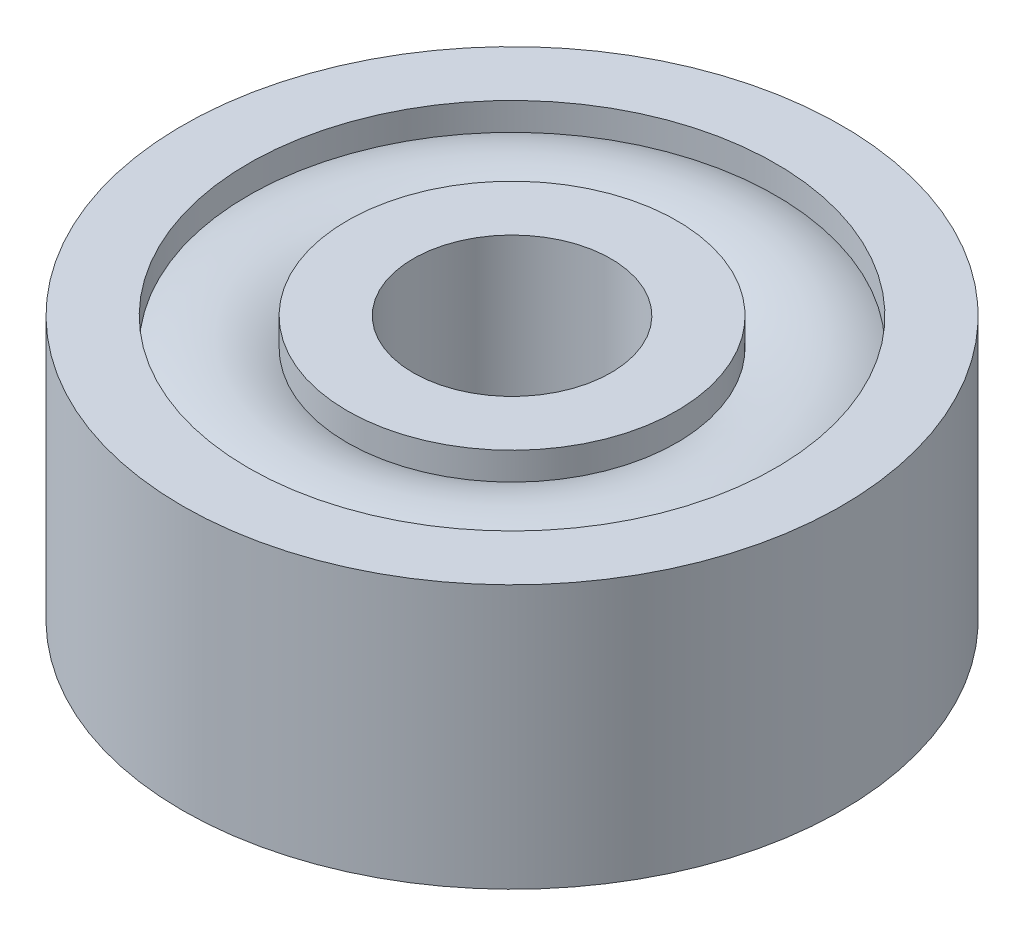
from build123d import *


with BuildPart() as part:
    # Sketch1 → Revolve1 (revolve)
    with BuildSketch(Plane.XY, mode=Mode.PRIVATE) as revolve1_sk:
        with BuildLine():
            Line((1.5, 2), (1.5, -2))
            Line((1.5, -2), (2.5, -2))
            Line((2.5, -2), (2.5, -1.58113883))
            ThreePointArc((2.5, -1.58113883), (3.25, -1.75), (4, -1.58113883))
            Line((4, -1.58113883), (4, -2))
            Line((4, -2), (5, -2))
            Line((5, -2), (5, 2))
            Line((5, 2), (4, 2))
            Line((4, 2), (4, 1.58113883))
            ThreePointArc((4, 1.58113883), (3.25, 1.75), (2.5, 1.58113883))
            Line((2.5, 1.58113883), (2.5, 2))
            Line((2.5, 2), (1.5, 2))
        make_face()
    revolve(revolve1_sk.sketch.rotate(Axis((0, 2, 0), (0, -1, 0)), 90), axis=Axis((0, 2, 0), (0, -1, 0)))


solid = part.part
